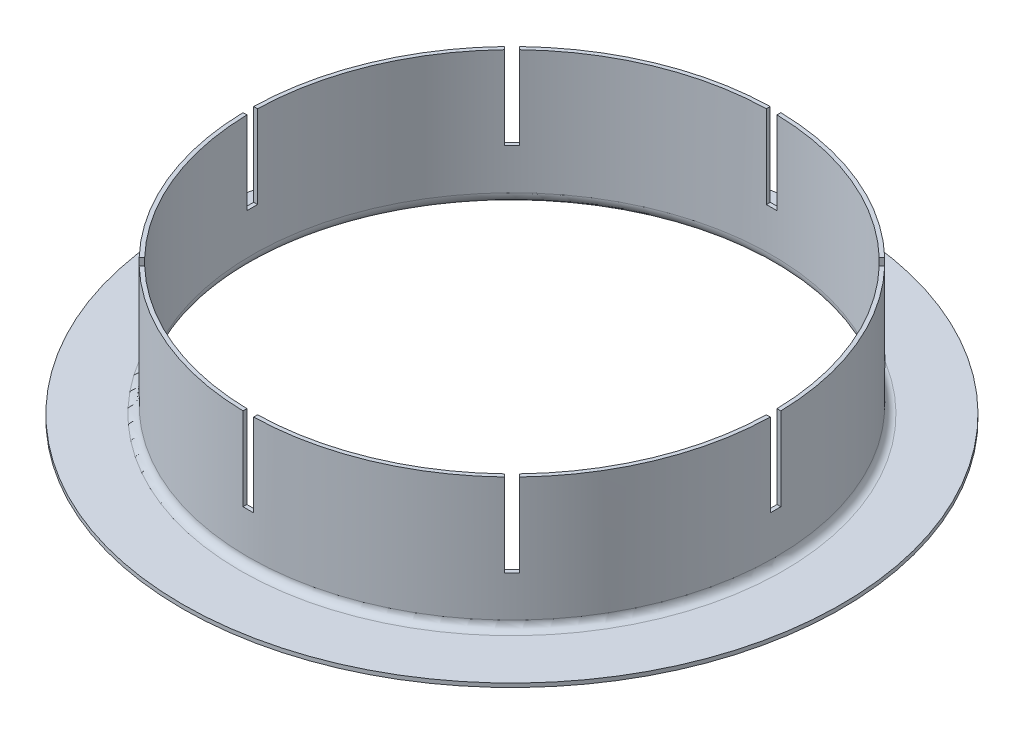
ISO-10303-21;
HEADER;
FILE_DESCRIPTION(('STEP AP214'),'2;1');
FILE_NAME('part.step','',(''),(''),'','','');
FILE_SCHEMA(('AUTOMOTIVE_DESIGN { 1 0 10303 214 1 1 1 1 }'));
ENDSEC;
DATA;
#1=APPLICATION_CONTEXT('core data for automotive mechanical design processes');
#2=APPLICATION_PROTOCOL_DEFINITION('international standard','automotive_design',2000,#1);
#3=PRODUCT_CONTEXT('',#1,'mechanical');
#4=PRODUCT('Part','Part','',(#3));
#5=PRODUCT_RELATED_PRODUCT_CATEGORY('part','',(#4));
#6=PRODUCT_DEFINITION_FORMATION('','',#4);
#7=PRODUCT_DEFINITION_CONTEXT('part definition',#1,'design');
#8=PRODUCT_DEFINITION('design','',#6,#7);
#9=PRODUCT_DEFINITION_SHAPE('','',#8);
#10=(LENGTH_UNIT() NAMED_UNIT(*) SI_UNIT(.MILLI.,.METRE.));
#11=(NAMED_UNIT(*) PLANE_ANGLE_UNIT() SI_UNIT($,.RADIAN.));
#12=(NAMED_UNIT(*) SI_UNIT($,.STERADIAN.) SOLID_ANGLE_UNIT());
#13=UNCERTAINTY_MEASURE_WITH_UNIT(LENGTH_MEASURE(1.E-05),#10,'distance_accuracy_value','');
#14=(GEOMETRIC_REPRESENTATION_CONTEXT(3) GLOBAL_UNCERTAINTY_ASSIGNED_CONTEXT((#13)) GLOBAL_UNIT_ASSIGNED_CONTEXT((#10,
#11,#12)) REPRESENTATION_CONTEXT('',''));
#15=CARTESIAN_POINT('',(0.,0.,0.));
#16=DIRECTION('',(0.,0.,1.));
#17=DIRECTION('',(1.,0.,0.));
#18=AXIS2_PLACEMENT_3D('',#15,#16,#17);
#19=CARTESIAN_POINT('',(0.,0.7366,0.));
#20=DIRECTION('',(0.,1.,0.));
#21=DIRECTION('',(0.,0.,1.));
#22=AXIS2_PLACEMENT_3D('',#19,#20,#21);
#23=CYLINDRICAL_SURFACE('',#22,49.2634000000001);
#24=CARTESIAN_POINT('',(0.,10.,0.));
#25=DIRECTION('',(0.,1.,0.));
#26=DIRECTION('',(0.,0.,1.));
#27=AXIS2_PLACEMENT_3D('',#24,#25,#26);
#28=CIRCLE('',#27,49.2634000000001);
#29=CARTESIAN_POINT('',(34.1201998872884,10.,-35.5344134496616));
#30=VERTEX_POINT('',#29);
#31=CARTESIAN_POINT('',(35.5344134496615,10.,-34.1201998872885));
#32=VERTEX_POINT('',#31);
#33=EDGE_CURVE('E333',#30,#32,#28,.F.);
#34=ORIENTED_EDGE('',*,*,#33,.F.);
#35=DIRECTION('',(0.,1.,0.));
#36=VECTOR('',#35,1.);
#37=CARTESIAN_POINT('',(34.1201998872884,0.7366,-35.5344134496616));
#38=LINE('',#37,#36);
#39=CARTESIAN_POINT('',(34.1201998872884,25.7366,-35.5344134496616));
#40=VERTEX_POINT('',#39);
#41=EDGE_CURVE('E325',#40,#30,#38,.F.);
#42=ORIENTED_EDGE('',*,*,#41,.F.);
#43=CARTESIAN_POINT('',(0.,25.7366,0.));
#44=DIRECTION('',(0.,1.,0.));
#45=DIRECTION('',(0.,0.,1.));
#46=AXIS2_PLACEMENT_3D('',#43,#44,#45);
#47=CIRCLE('',#46,49.2634000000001);
#48=CARTESIAN_POINT('',(0.999999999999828,25.7366,-49.2532494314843));
#49=VERTEX_POINT('',#48);
#50=EDGE_CURVE('E548',#40,#49,#47,.T.);
#51=ORIENTED_EDGE('',*,*,#50,.T.);
#52=DIRECTION('',(0.,1.,0.));
#53=VECTOR('',#52,1.);
#54=CARTESIAN_POINT('',(0.999999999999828,0.7366,-49.2532494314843));
#55=LINE('',#54,#53);
#56=CARTESIAN_POINT('',(0.999999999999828,10.,-49.2532494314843));
#57=VERTEX_POINT('',#56);
#58=EDGE_CURVE('E477',#57,#49,#55,.T.);
#59=ORIENTED_EDGE('',*,*,#58,.F.);
#60=CARTESIAN_POINT('',(0.,10.,0.));
#61=DIRECTION('',(0.,1.,0.));
#62=DIRECTION('',(0.,0.,1.));
#63=AXIS2_PLACEMENT_3D('',#60,#61,#62);
#64=CIRCLE('',#63,49.2634000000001);
#65=CARTESIAN_POINT('',(-1.00000000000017,10.,-49.2532494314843));
#66=VERTEX_POINT('',#65);
#67=EDGE_CURVE('E503',#66,#57,#64,.F.);
#68=ORIENTED_EDGE('',*,*,#67,.F.);
#69=DIRECTION('',(0.,1.,0.));
#70=VECTOR('',#69,1.);
#71=CARTESIAN_POINT('',(-1.00000000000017,0.7366,-49.2532494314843));
#72=LINE('',#71,#70);
#73=CARTESIAN_POINT('',(-1.00000000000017,25.7366,-49.2532494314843));
#74=VERTEX_POINT('',#73);
#75=EDGE_CURVE('E484',#74,#66,#72,.F.);
#76=ORIENTED_EDGE('',*,*,#75,.F.);
#77=CARTESIAN_POINT('',(-34.1201998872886,25.7366,-35.5344134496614));
#78=VERTEX_POINT('',#77);
#79=EDGE_CURVE('E630',#74,#78,#47,.T.);
#80=ORIENTED_EDGE('',*,*,#79,.T.);
#81=DIRECTION('',(0.,1.,0.));
#82=VECTOR('',#81,1.);
#83=CARTESIAN_POINT('',(-34.1201998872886,0.7366,-35.5344134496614));
#84=LINE('',#83,#82);
#85=CARTESIAN_POINT('',(-34.1201998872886,10.,-35.5344134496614));
#86=VERTEX_POINT('',#85);
#87=EDGE_CURVE('E451',#86,#78,#84,.T.);
#88=ORIENTED_EDGE('',*,*,#87,.F.);
#89=CARTESIAN_POINT('',(0.,10.,0.));
#90=DIRECTION('',(0.,1.,0.));
#91=DIRECTION('',(0.,0.,1.));
#92=AXIS2_PLACEMENT_3D('',#89,#90,#91);
#93=CIRCLE('',#92,49.2634000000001);
#94=CARTESIAN_POINT('',(-35.5344134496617,10.,-34.1201998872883));
#95=VERTEX_POINT('',#94);
#96=EDGE_CURVE('E475',#95,#86,#93,.F.);
#97=ORIENTED_EDGE('',*,*,#96,.F.);
#98=DIRECTION('',(0.,1.,0.));
#99=VECTOR('',#98,1.);
#100=CARTESIAN_POINT('',(-35.5344134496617,0.7366,-34.1201998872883));
#101=LINE('',#100,#99);
#102=CARTESIAN_POINT('',(-35.5344134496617,25.7366,-34.1201998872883));
#103=VERTEX_POINT('',#102);
#104=EDGE_CURVE('E458',#103,#95,#101,.F.);
#105=ORIENTED_EDGE('',*,*,#104,.F.);
#106=CARTESIAN_POINT('',(-49.2532494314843,25.7366,-0.999999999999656));
#107=VERTEX_POINT('',#106);
#108=EDGE_CURVE('E628',#103,#107,#47,.T.);
#109=ORIENTED_EDGE('',*,*,#108,.T.);
#110=DIRECTION('',(0.,1.,0.));
#111=VECTOR('',#110,1.);
#112=CARTESIAN_POINT('',(-49.2532494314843,0.7366,-0.999999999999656));
#113=LINE('',#112,#111);
#114=CARTESIAN_POINT('',(-49.2532494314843,10.,-0.999999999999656));
#115=VERTEX_POINT('',#114);
#116=EDGE_CURVE('E425',#115,#107,#113,.T.);
#117=ORIENTED_EDGE('',*,*,#116,.F.);
#118=CARTESIAN_POINT('',(0.,10.,0.));
#119=DIRECTION('',(0.,1.,0.));
#120=DIRECTION('',(0.,0.,1.));
#121=AXIS2_PLACEMENT_3D('',#118,#119,#120);
#122=CIRCLE('',#121,49.2634000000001);
#123=CARTESIAN_POINT('',(-49.2532494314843,10.,1.00000000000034));
#124=VERTEX_POINT('',#123);
#125=EDGE_CURVE('E449',#124,#115,#122,.F.);
#126=ORIENTED_EDGE('',*,*,#125,.F.);
#127=DIRECTION('',(0.,1.,0.));
#128=VECTOR('',#127,1.);
#129=CARTESIAN_POINT('',(-49.2532494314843,0.7366,1.00000000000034));
#130=LINE('',#129,#128);
#131=CARTESIAN_POINT('',(-49.2532494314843,25.7366,1.00000000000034));
#132=VERTEX_POINT('',#131);
#133=EDGE_CURVE('E432',#132,#124,#130,.F.);
#134=ORIENTED_EDGE('',*,*,#133,.F.);
#135=CARTESIAN_POINT('',(-35.5344134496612,25.7366,34.1201998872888));
#136=VERTEX_POINT('',#135);
#137=EDGE_CURVE('E631',#132,#136,#47,.T.);
#138=ORIENTED_EDGE('',*,*,#137,.T.);
#139=DIRECTION('',(0.,1.,0.));
#140=VECTOR('',#139,1.);
#141=CARTESIAN_POINT('',(-35.5344134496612,0.7366,34.1201998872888));
#142=LINE('',#141,#140);
#143=CARTESIAN_POINT('',(-35.5344134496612,10.,34.1201998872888));
#144=VERTEX_POINT('',#143);
#145=EDGE_CURVE('E400',#144,#136,#142,.T.);
#146=ORIENTED_EDGE('',*,*,#145,.F.);
#147=CARTESIAN_POINT('',(0.,10.,0.));
#148=DIRECTION('',(0.,1.,0.));
#149=DIRECTION('',(0.,0.,1.));
#150=AXIS2_PLACEMENT_3D('',#147,#148,#149);
#151=CIRCLE('',#150,49.2634000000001);
#152=CARTESIAN_POINT('',(-34.1201998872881,10.,35.5344134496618));
#153=VERTEX_POINT('',#152);
#154=EDGE_CURVE('E423',#153,#144,#151,.F.);
#155=ORIENTED_EDGE('',*,*,#154,.F.);
#156=DIRECTION('',(0.,1.,0.));
#157=VECTOR('',#156,1.);
#158=CARTESIAN_POINT('',(-34.1201998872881,0.7366,35.5344134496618));
#159=LINE('',#158,#157);
#160=CARTESIAN_POINT('',(-34.1201998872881,25.7366,35.5344134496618));
#161=VERTEX_POINT('',#160);
#162=EDGE_CURVE('E406',#161,#153,#159,.F.);
#163=ORIENTED_EDGE('',*,*,#162,.F.);
#164=CARTESIAN_POINT('',(-0.999999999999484,25.7366,49.2532494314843));
#165=VERTEX_POINT('',#164);
#166=EDGE_CURVE('E542',#161,#165,#47,.T.);
#167=ORIENTED_EDGE('',*,*,#166,.T.);
#168=DIRECTION('',(0.,1.,0.));
#169=VECTOR('',#168,1.);
#170=CARTESIAN_POINT('',(-0.999999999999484,0.7366,49.2532494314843));
#171=LINE('',#170,#169);
#172=CARTESIAN_POINT('',(-0.999999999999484,10.,49.2532494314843));
#173=VERTEX_POINT('',#172);
#174=EDGE_CURVE('E369',#173,#165,#171,.T.);
#175=ORIENTED_EDGE('',*,*,#174,.F.);
#176=CARTESIAN_POINT('',(0.,10.,0.));
#177=DIRECTION('',(0.,1.,0.));
#178=DIRECTION('',(0.,0.,1.));
#179=AXIS2_PLACEMENT_3D('',#176,#177,#178);
#180=CIRCLE('',#179,49.2634000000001);
#181=CARTESIAN_POINT('',(0.,10.,49.2634000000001));
#182=VERTEX_POINT('',#181);
#183=EDGE_CURVE('E382',#182,#173,#180,.F.);
#184=ORIENTED_EDGE('',*,*,#183,.F.);
#185=DIRECTION('',(0.,1.,0.));
#186=VECTOR('',#185,1.);
#187=CARTESIAN_POINT('',(0.,0.7366,49.2634000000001));
#188=LINE('',#187,#186);
#189=CARTESIAN_POINT('',(0.,2.23660000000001,49.2634));
#190=VERTEX_POINT('',#189);
#191=EDGE_CURVE('E535',#190,#182,#188,.T.);
#192=ORIENTED_EDGE('',*,*,#191,.F.);
#193=CARTESIAN_POINT('',(0.,2.23660000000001,0.));
#194=DIRECTION('',(0.,1.,0.));
#195=DIRECTION('',(0.,0.,1.));
#196=AXIS2_PLACEMENT_3D('',#193,#194,#195);
#197=CIRCLE('',#196,49.2634);
#198=EDGE_CURVE('E540',#190,#190,#197,.T.);
#199=ORIENTED_EDGE('',*,*,#198,.F.);
#200=ORIENTED_EDGE('',*,*,#191,.T.);
#201=CARTESIAN_POINT('',(0.,10.,0.));
#202=DIRECTION('',(0.,1.,0.));
#203=DIRECTION('',(0.,0.,1.));
#204=AXIS2_PLACEMENT_3D('',#201,#202,#203);
#205=CIRCLE('',#204,49.2634000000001);
#206=CARTESIAN_POINT('',(1.00000000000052,10.,49.2532494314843));
#207=VERTEX_POINT('',#206);
#208=EDGE_CURVE('E398',#207,#182,#205,.F.);
#209=ORIENTED_EDGE('',*,*,#208,.F.);
#210=DIRECTION('',(0.,1.,0.));
#211=VECTOR('',#210,1.);
#212=CARTESIAN_POINT('',(1.00000000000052,0.7366,49.2532494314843));
#213=LINE('',#212,#211);
#214=CARTESIAN_POINT('',(1.00000000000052,25.7366,49.2532494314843));
#215=VERTEX_POINT('',#214);
#216=EDGE_CURVE('E384',#215,#207,#213,.F.);
#217=ORIENTED_EDGE('',*,*,#216,.F.);
#218=CARTESIAN_POINT('',(34.1201998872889,25.7366,35.5344134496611));
#219=VERTEX_POINT('',#218);
#220=EDGE_CURVE('E543',#215,#219,#47,.T.);
#221=ORIENTED_EDGE('',*,*,#220,.T.);
#222=DIRECTION('',(0.,1.,0.));
#223=VECTOR('',#222,1.);
#224=CARTESIAN_POINT('',(34.1201998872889,0.7366,35.5344134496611));
#225=LINE('',#224,#223);
#226=CARTESIAN_POINT('',(34.1201998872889,10.,35.5344134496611));
#227=VERTEX_POINT('',#226);
#228=EDGE_CURVE('E111',#227,#219,#225,.T.);
#229=ORIENTED_EDGE('',*,*,#228,.F.);
#230=CARTESIAN_POINT('',(0.,10.,0.));
#231=DIRECTION('',(0.,1.,0.));
#232=DIRECTION('',(0.,0.,1.));
#233=AXIS2_PLACEMENT_3D('',#230,#231,#232);
#234=CIRCLE('',#233,49.2634000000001);
#235=CARTESIAN_POINT('',(35.534413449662,10.,34.120199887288));
#236=VERTEX_POINT('',#235);
#237=EDGE_CURVE('E367',#236,#227,#234,.F.);
#238=ORIENTED_EDGE('',*,*,#237,.F.);
#239=DIRECTION('',(0.,1.,0.));
#240=VECTOR('',#239,1.);
#241=CARTESIAN_POINT('',(35.534413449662,0.7366,34.120199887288));
#242=LINE('',#241,#240);
#243=CARTESIAN_POINT('',(35.534413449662,25.7366,34.120199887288));
#244=VERTEX_POINT('',#243);
#245=EDGE_CURVE('E350',#244,#236,#242,.F.);
#246=ORIENTED_EDGE('',*,*,#245,.F.);
#247=CARTESIAN_POINT('',(49.2532494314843,25.7366,1.));
#248=VERTEX_POINT('',#247);
#249=EDGE_CURVE('E547',#244,#248,#47,.T.);
#250=ORIENTED_EDGE('',*,*,#249,.T.);
#251=DIRECTION('',(0.,1.,0.));
#252=VECTOR('',#251,1.);
#253=CARTESIAN_POINT('',(49.2532494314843,0.7366,1.));
#254=LINE('',#253,#252);
#255=CARTESIAN_POINT('',(49.2532494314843,10.,1.));
#256=VERTEX_POINT('',#255);
#257=EDGE_CURVE('E515',#256,#248,#254,.T.);
#258=ORIENTED_EDGE('',*,*,#257,.F.);
#259=CARTESIAN_POINT('',(0.,10.,0.));
#260=DIRECTION('',(0.,1.,0.));
#261=DIRECTION('',(0.,0.,1.));
#262=AXIS2_PLACEMENT_3D('',#259,#260,#261);
#263=CIRCLE('',#262,49.2634000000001);
#264=CARTESIAN_POINT('',(49.2532494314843,10.,-1.));
#265=VERTEX_POINT('',#264);
#266=EDGE_CURVE('E513',#265,#256,#263,.F.);
#267=ORIENTED_EDGE('',*,*,#266,.F.);
#268=DIRECTION('',(0.,1.,0.));
#269=VECTOR('',#268,1.);
#270=CARTESIAN_POINT('',(49.2532494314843,0.7366,-1.));
#271=LINE('',#270,#269);
#272=CARTESIAN_POINT('',(49.2532494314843,25.7366,-1.));
#273=VERTEX_POINT('',#272);
#274=EDGE_CURVE('E532',#273,#265,#271,.F.);
#275=ORIENTED_EDGE('',*,*,#274,.F.);
#276=CARTESIAN_POINT('',(35.5344134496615,25.7366,-34.1201998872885));
#277=VERTEX_POINT('',#276);
#278=EDGE_CURVE('E549',#273,#277,#47,.T.);
#279=ORIENTED_EDGE('',*,*,#278,.T.);
#280=DIRECTION('',(0.,1.,0.));
#281=VECTOR('',#280,1.);
#282=CARTESIAN_POINT('',(35.5344134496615,0.7366,-34.1201998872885));
#283=LINE('',#282,#281);
#284=EDGE_CURVE('E103',#32,#277,#283,.T.);
#285=ORIENTED_EDGE('',*,*,#284,.F.);
#286=EDGE_LOOP('',(#34,#42,#51,#59,#68,#76,#80,#88,#97,#105,#109,#117,#126,#134,#138,#146,#155,
#163,#167,#175,#184,#192,#199,#200,#209,#217,#221,#229,#238,#246,#250,#258,#267,#275,#279,#285));
#287=FACE_BOUND('',#286,.T.);
#288=ADVANCED_FACE('F86',(#287),#23,.F.);
#289=CARTESIAN_POINT('',(0.,0.7366,0.));
#290=DIRECTION('',(0.,1.,0.));
#291=DIRECTION('',(0.,0.,1.));
#292=AXIS2_PLACEMENT_3D('',#289,#290,#291);
#293=CYLINDRICAL_SURFACE('',#292,50.);
#294=DIRECTION('',(0.,1.,0.));
#295=VECTOR('',#294,1.);
#296=CARTESIAN_POINT('',(34.6303745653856,0.7366,-36.0657338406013));
#297=LINE('',#296,#295);
#298=CARTESIAN_POINT('',(34.6303745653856,25.7366,-36.0657338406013));
#299=VERTEX_POINT('',#298);
#300=CARTESIAN_POINT('',(34.6303745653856,10.,-36.0657338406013));
#301=VERTEX_POINT('',#300);
#302=EDGE_CURVE('E324',#299,#301,#297,.F.);
#303=ORIENTED_EDGE('',*,*,#302,.T.);
#304=CARTESIAN_POINT('',(0.,10.,0.));
#305=DIRECTION('',(0.,1.,0.));
#306=DIRECTION('',(0.,0.,1.));
#307=AXIS2_PLACEMENT_3D('',#304,#305,#306);
#308=CIRCLE('',#307,50.);
#309=CARTESIAN_POINT('',(36.0657338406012,10.,-34.6303745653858));
#310=VERTEX_POINT('',#309);
#311=EDGE_CURVE('E330',#301,#310,#308,.F.);
#312=ORIENTED_EDGE('',*,*,#311,.T.);
#313=DIRECTION('',(0.,1.,0.));
#314=VECTOR('',#313,1.);
#315=CARTESIAN_POINT('',(36.0657338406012,0.7366,-34.6303745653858));
#316=LINE('',#315,#314);
#317=CARTESIAN_POINT('',(36.0657338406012,25.7366,-34.6303745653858));
#318=VERTEX_POINT('',#317);
#319=EDGE_CURVE('E315',#310,#318,#316,.T.);
#320=ORIENTED_EDGE('',*,*,#319,.T.);
#321=CARTESIAN_POINT('',(0.,25.7366,0.));
#322=DIRECTION('',(0.,1.,0.));
#323=DIRECTION('',(0.,0.,1.));
#324=AXIS2_PLACEMENT_3D('',#321,#322,#323);
#325=CIRCLE('',#324,50.0000000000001);
#326=CARTESIAN_POINT('',(49.9899989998,25.7366,-1.));
#327=VERTEX_POINT('',#326);
#328=EDGE_CURVE('E562',#327,#318,#325,.T.);
#329=ORIENTED_EDGE('',*,*,#328,.F.);
#330=DIRECTION('',(0.,1.,0.));
#331=VECTOR('',#330,1.);
#332=CARTESIAN_POINT('',(49.9899989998,0.7366,-1.));
#333=LINE('',#332,#331);
#334=CARTESIAN_POINT('',(49.9899989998,10.,-1.));
#335=VERTEX_POINT('',#334);
#336=EDGE_CURVE('E527',#327,#335,#333,.F.);
#337=ORIENTED_EDGE('',*,*,#336,.T.);
#338=CARTESIAN_POINT('',(0.,10.,0.));
#339=DIRECTION('',(0.,1.,0.));
#340=DIRECTION('',(0.,0.,1.));
#341=AXIS2_PLACEMENT_3D('',#338,#339,#340);
#342=CIRCLE('',#341,50.);
#343=CARTESIAN_POINT('',(49.9899989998,10.,1.));
#344=VERTEX_POINT('',#343);
#345=EDGE_CURVE('E505',#335,#344,#342,.F.);
#346=ORIENTED_EDGE('',*,*,#345,.T.);
#347=DIRECTION('',(0.,1.,0.));
#348=VECTOR('',#347,1.);
#349=CARTESIAN_POINT('',(49.9899989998,0.7366,1.));
#350=LINE('',#349,#348);
#351=CARTESIAN_POINT('',(49.9899989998,25.7366,1.));
#352=VERTEX_POINT('',#351);
#353=EDGE_CURVE('E510',#344,#352,#350,.T.);
#354=ORIENTED_EDGE('',*,*,#353,.T.);
#355=CARTESIAN_POINT('',(36.0657338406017,25.7366,34.6303745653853));
#356=VERTEX_POINT('',#355);
#357=EDGE_CURVE('E560',#356,#352,#325,.T.);
#358=ORIENTED_EDGE('',*,*,#357,.F.);
#359=DIRECTION('',(0.,1.,0.));
#360=VECTOR('',#359,1.);
#361=CARTESIAN_POINT('',(36.0657338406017,0.7366,34.6303745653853));
#362=LINE('',#361,#360);
#363=CARTESIAN_POINT('',(36.0657338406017,10.,34.6303745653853));
#364=VERTEX_POINT('',#363);
#365=EDGE_CURVE('E349',#356,#364,#362,.F.);
#366=ORIENTED_EDGE('',*,*,#365,.T.);
#367=CARTESIAN_POINT('',(0.,10.,0.));
#368=DIRECTION('',(0.,1.,0.));
#369=DIRECTION('',(0.,0.,1.));
#370=AXIS2_PLACEMENT_3D('',#367,#368,#369);
#371=CIRCLE('',#370,50.);
#372=CARTESIAN_POINT('',(34.6303745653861,10.,36.0657338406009));
#373=VERTEX_POINT('',#372);
#374=EDGE_CURVE('E365',#364,#373,#371,.F.);
#375=ORIENTED_EDGE('',*,*,#374,.T.);
#376=DIRECTION('',(0.,1.,0.));
#377=VECTOR('',#376,1.);
#378=CARTESIAN_POINT('',(34.6303745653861,0.7366,36.0657338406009));
#379=LINE('',#378,#377);
#380=CARTESIAN_POINT('',(34.6303745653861,25.7366,36.0657338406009));
#381=VERTEX_POINT('',#380);
#382=EDGE_CURVE('E346',#373,#381,#379,.T.);
#383=ORIENTED_EDGE('',*,*,#382,.T.);
#384=CARTESIAN_POINT('',(1.01495227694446,25.7366,49.9896976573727));
#385=VERTEX_POINT('',#384);
#386=EDGE_CURVE('E557',#385,#381,#325,.T.);
#387=ORIENTED_EDGE('',*,*,#386,.F.);
#388=DIRECTION('',(0.,1.,0.));
#389=VECTOR('',#388,1.);
#390=CARTESIAN_POINT('',(1.01495227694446,0.7366,49.9896976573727));
#391=LINE('',#390,#389);
#392=CARTESIAN_POINT('',(1.01495227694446,10.,49.9896976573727));
#393=VERTEX_POINT('',#392);
#394=EDGE_CURVE('E387',#385,#393,#391,.F.);
#395=ORIENTED_EDGE('',*,*,#394,.T.);
#396=CARTESIAN_POINT('',(0.,10.,0.));
#397=DIRECTION('',(0.,1.,0.));
#398=DIRECTION('',(0.,0.,1.));
#399=AXIS2_PLACEMENT_3D('',#396,#397,#398);
#400=CIRCLE('',#399,50.);
#401=CARTESIAN_POINT('',(0.,10.,50.));
#402=VERTEX_POINT('',#401);
#403=EDGE_CURVE('E397',#393,#402,#400,.F.);
#404=ORIENTED_EDGE('',*,*,#403,.T.);
#405=DIRECTION('',(0.,1.,0.));
#406=VECTOR('',#405,1.);
#407=CARTESIAN_POINT('',(0.,0.7366,50.));
#408=LINE('',#407,#406);
#409=CARTESIAN_POINT('',(0.,2.23660000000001,50.));
#410=VERTEX_POINT('',#409);
#411=EDGE_CURVE('E554',#410,#402,#408,.T.);
#412=ORIENTED_EDGE('',*,*,#411,.F.);
#413=CARTESIAN_POINT('',(0.,2.23660000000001,0.));
#414=DIRECTION('',(0.,1.,0.));
#415=DIRECTION('',(0.,0.,1.));
#416=AXIS2_PLACEMENT_3D('',#413,#414,#415);
#417=CIRCLE('',#416,50.);
#418=EDGE_CURVE('E550',#410,#410,#417,.T.);
#419=ORIENTED_EDGE('',*,*,#418,.T.);
#420=ORIENTED_EDGE('',*,*,#411,.T.);
#421=CARTESIAN_POINT('',(0.,10.,0.));
#422=DIRECTION('',(0.,1.,0.));
#423=DIRECTION('',(0.,0.,1.));
#424=AXIS2_PLACEMENT_3D('',#421,#422,#423);
#425=CIRCLE('',#424,50.);
#426=CARTESIAN_POINT('',(-1.01495227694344,10.,49.9896976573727));
#427=VERTEX_POINT('',#426);
#428=EDGE_CURVE('E380',#402,#427,#425,.F.);
#429=ORIENTED_EDGE('',*,*,#428,.T.);
#430=DIRECTION('',(0.,1.,0.));
#431=VECTOR('',#430,1.);
#432=CARTESIAN_POINT('',(-1.01495227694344,0.7366,49.9896976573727));
#433=LINE('',#432,#431);
#434=CARTESIAN_POINT('',(-1.01495227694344,25.7366,49.9896976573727));
#435=VERTEX_POINT('',#434);
#436=EDGE_CURVE('E372',#427,#435,#433,.T.);
#437=ORIENTED_EDGE('',*,*,#436,.T.);
#438=CARTESIAN_POINT('',(-34.6303745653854,25.7366,36.0657338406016));
#439=VERTEX_POINT('',#438);
#440=EDGE_CURVE('E553',#439,#435,#325,.T.);
#441=ORIENTED_EDGE('',*,*,#440,.F.);
#442=DIRECTION('',(0.,1.,0.));
#443=VECTOR('',#442,1.);
#444=CARTESIAN_POINT('',(-34.6303745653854,0.7366,36.0657338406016));
#445=LINE('',#444,#443);
#446=CARTESIAN_POINT('',(-34.6303745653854,10.,36.0657338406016));
#447=VERTEX_POINT('',#446);
#448=EDGE_CURVE('E405',#439,#447,#445,.F.);
#449=ORIENTED_EDGE('',*,*,#448,.T.);
#450=CARTESIAN_POINT('',(0.,10.,0.));
#451=DIRECTION('',(0.,1.,0.));
#452=DIRECTION('',(0.,0.,1.));
#453=AXIS2_PLACEMENT_3D('',#450,#451,#452);
#454=CIRCLE('',#453,50.);
#455=CARTESIAN_POINT('',(-36.065733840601,10.,34.630374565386));
#456=VERTEX_POINT('',#455);
#457=EDGE_CURVE('E421',#447,#456,#454,.F.);
#458=ORIENTED_EDGE('',*,*,#457,.T.);
#459=DIRECTION('',(0.,1.,0.));
#460=VECTOR('',#459,1.);
#461=CARTESIAN_POINT('',(-36.065733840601,0.7366,34.630374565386));
#462=LINE('',#461,#460);
#463=CARTESIAN_POINT('',(-36.065733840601,25.7366,34.630374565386));
#464=VERTEX_POINT('',#463);
#465=EDGE_CURVE('E402',#456,#464,#462,.T.);
#466=ORIENTED_EDGE('',*,*,#465,.T.);
#467=CARTESIAN_POINT('',(-49.9896976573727,25.7366,1.01495227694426));
#468=VERTEX_POINT('',#467);
#469=EDGE_CURVE('E595',#468,#464,#325,.T.);
#470=ORIENTED_EDGE('',*,*,#469,.F.);
#471=DIRECTION('',(0.,1.,0.));
#472=VECTOR('',#471,1.);
#473=CARTESIAN_POINT('',(-49.9896976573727,0.7366,1.01495227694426));
#474=LINE('',#473,#472);
#475=CARTESIAN_POINT('',(-49.9896976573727,10.,1.01495227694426));
#476=VERTEX_POINT('',#475);
#477=EDGE_CURVE('E431',#468,#476,#474,.F.);
#478=ORIENTED_EDGE('',*,*,#477,.T.);
#479=CARTESIAN_POINT('',(0.,10.,0.));
#480=DIRECTION('',(0.,1.,0.));
#481=DIRECTION('',(0.,0.,1.));
#482=AXIS2_PLACEMENT_3D('',#479,#480,#481);
#483=CIRCLE('',#482,50.);
#484=CARTESIAN_POINT('',(-49.9896976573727,10.,-1.01495227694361));
#485=VERTEX_POINT('',#484);
#486=EDGE_CURVE('E447',#476,#485,#483,.F.);
#487=ORIENTED_EDGE('',*,*,#486,.T.);
#488=DIRECTION('',(0.,1.,0.));
#489=VECTOR('',#488,1.);
#490=CARTESIAN_POINT('',(-49.9896976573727,0.7366,-1.01495227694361));
#491=LINE('',#490,#489);
#492=CARTESIAN_POINT('',(-49.9896976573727,25.7366,-1.01495227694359));
#493=VERTEX_POINT('',#492);
#494=EDGE_CURVE('E428',#485,#493,#491,.T.);
#495=ORIENTED_EDGE('',*,*,#494,.T.);
#496=CARTESIAN_POINT('',(-36.0657338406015,25.7366,-34.6303745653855));
#497=VERTEX_POINT('',#496);
#498=EDGE_CURVE('E597',#497,#493,#325,.T.);
#499=ORIENTED_EDGE('',*,*,#498,.F.);
#500=DIRECTION('',(0.,1.,0.));
#501=VECTOR('',#500,1.);
#502=CARTESIAN_POINT('',(-36.0657338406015,0.7366,-34.6303745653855));
#503=LINE('',#502,#501);
#504=CARTESIAN_POINT('',(-36.0657338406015,10.,-34.6303745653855));
#505=VERTEX_POINT('',#504);
#506=EDGE_CURVE('E457',#497,#505,#503,.F.);
#507=ORIENTED_EDGE('',*,*,#506,.T.);
#508=CARTESIAN_POINT('',(0.,10.,0.));
#509=DIRECTION('',(0.,1.,0.));
#510=DIRECTION('',(0.,0.,1.));
#511=AXIS2_PLACEMENT_3D('',#508,#509,#510);
#512=CIRCLE('',#511,50.);
#513=CARTESIAN_POINT('',(-34.6303745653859,10.,-36.0657338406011));
#514=VERTEX_POINT('',#513);
#515=EDGE_CURVE('E473',#505,#514,#512,.F.);
#516=ORIENTED_EDGE('',*,*,#515,.T.);
#517=DIRECTION('',(0.,1.,0.));
#518=VECTOR('',#517,1.);
#519=CARTESIAN_POINT('',(-34.6303745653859,0.7366,-36.0657338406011));
#520=LINE('',#519,#518);
#521=CARTESIAN_POINT('',(-34.6303745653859,25.7366,-36.0657338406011));
#522=VERTEX_POINT('',#521);
#523=EDGE_CURVE('E454',#514,#522,#520,.T.);
#524=ORIENTED_EDGE('',*,*,#523,.T.);
#525=CARTESIAN_POINT('',(-1.01495227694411,25.7366,-49.9896976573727));
#526=VERTEX_POINT('',#525);
#527=EDGE_CURVE('E601',#526,#522,#325,.T.);
#528=ORIENTED_EDGE('',*,*,#527,.F.);
#529=DIRECTION('',(0.,1.,0.));
#530=VECTOR('',#529,1.);
#531=CARTESIAN_POINT('',(-1.01495227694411,0.7366,-49.9896976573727));
#532=LINE('',#531,#530);
#533=CARTESIAN_POINT('',(-1.01495227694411,10.,-49.9896976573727));
#534=VERTEX_POINT('',#533);
#535=EDGE_CURVE('E483',#526,#534,#532,.F.);
#536=ORIENTED_EDGE('',*,*,#535,.T.);
#537=CARTESIAN_POINT('',(0.,10.,0.));
#538=DIRECTION('',(0.,1.,0.));
#539=DIRECTION('',(0.,0.,1.));
#540=AXIS2_PLACEMENT_3D('',#537,#538,#539);
#541=CIRCLE('',#540,50.);
#542=CARTESIAN_POINT('',(1.01495227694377,10.,-49.9896976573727));
#543=VERTEX_POINT('',#542);
#544=EDGE_CURVE('E500',#534,#543,#541,.F.);
#545=ORIENTED_EDGE('',*,*,#544,.T.);
#546=DIRECTION('',(0.,1.,0.));
#547=VECTOR('',#546,1.);
#548=CARTESIAN_POINT('',(1.01495227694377,0.7366,-49.9896976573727));
#549=LINE('',#548,#547);
#550=CARTESIAN_POINT('',(1.01495227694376,25.7366,-49.9896976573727));
#551=VERTEX_POINT('',#550);
#552=EDGE_CURVE('E480',#543,#551,#549,.T.);
#553=ORIENTED_EDGE('',*,*,#552,.T.);
#554=EDGE_CURVE('E561',#299,#551,#325,.T.);
#555=ORIENTED_EDGE('',*,*,#554,.F.);
#556=EDGE_LOOP('',(#303,#312,#320,#329,#337,#346,#354,#358,#366,#375,#383,#387,#395,#404,#412,
#419,#420,#429,#437,#441,#449,#458,#466,#470,#478,#487,#495,#499,#507,#516,#524,#528,#536,#545,
#553,#555));
#557=FACE_BOUND('',#556,.T.);
#558=ADVANCED_FACE('F337',(#557),#293,.T.);
#559=CARTESIAN_POINT('',(0.,25.7366,0.));
#560=DIRECTION('',(0.,-1.,0.));
#561=DIRECTION('',(0.,0.,-1.));
#562=AXIS2_PLACEMENT_3D('',#559,#560,#561);
#563=PLANE('',#562);
#564=ORIENTED_EDGE('',*,*,#50,.F.);
#565=DIRECTION('',(-0.692607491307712,0.,0.721314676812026));
#566=VECTOR('',#565,1.);
#567=CARTESIAN_POINT('',(34.1201998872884,25.7366,-35.5344134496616));
#568=LINE('',#567,#566);
#569=EDGE_CURVE('E339',#40,#299,#568,.F.);
#570=ORIENTED_EDGE('',*,*,#569,.T.);
#571=ORIENTED_EDGE('',*,*,#554,.T.);
#572=DIRECTION('',(-0.0202990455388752,0.,0.999793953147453));
#573=VECTOR('',#572,1.);
#574=CARTESIAN_POINT('',(0.999999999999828,25.7366,-49.2532494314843));
#575=LINE('',#574,#573);
#576=EDGE_CURVE('E487',#49,#551,#575,.F.);
#577=ORIENTED_EDGE('',*,*,#576,.F.);
#578=EDGE_LOOP('',(#564,#570,#571,#577));
#579=FACE_BOUND('',#578,.T.);
#580=ADVANCED_FACE('F647',(#579),#563,.F.);
#581=ORIENTED_EDGE('',*,*,#328,.T.);
#582=DIRECTION('',(-0.721314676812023,0.,0.692607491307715));
#583=VECTOR('',#582,1.);
#584=CARTESIAN_POINT('',(35.5344134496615,25.7366,-34.1201998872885));
#585=LINE('',#584,#583);
#586=EDGE_CURVE('E319',#277,#318,#585,.F.);
#587=ORIENTED_EDGE('',*,*,#586,.F.);
#588=ORIENTED_EDGE('',*,*,#278,.F.);
#589=DIRECTION('',(1.,0.,0.));
#590=VECTOR('',#589,1.);
#591=CARTESIAN_POINT('',(62.501,25.7366,-1.));
#592=LINE('',#591,#590);
#593=EDGE_CURVE('E530',#327,#273,#592,.F.);
#594=ORIENTED_EDGE('',*,*,#593,.F.);
#595=EDGE_LOOP('',(#581,#587,#588,#594));
#596=FACE_BOUND('',#595,.T.);
#597=ADVANCED_FACE('F649',(#596),#563,.F.);
#598=ORIENTED_EDGE('',*,*,#249,.F.);
#599=DIRECTION('',(-0.721314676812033,0.,-0.692607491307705));
#600=VECTOR('',#599,1.);
#601=CARTESIAN_POINT('',(35.534413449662,25.7366,34.120199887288));
#602=LINE('',#601,#600);
#603=EDGE_CURVE('E362',#244,#356,#602,.F.);
#604=ORIENTED_EDGE('',*,*,#603,.T.);
#605=ORIENTED_EDGE('',*,*,#357,.T.);
#606=DIRECTION('',(-1.,0.,0.));
#607=VECTOR('',#606,1.);
#608=CARTESIAN_POINT('',(62.501,25.7366,1.));
#609=LINE('',#608,#607);
#610=EDGE_CURVE('E518',#248,#352,#609,.F.);
#611=ORIENTED_EDGE('',*,*,#610,.F.);
#612=EDGE_LOOP('',(#598,#604,#605,#611));
#613=FACE_BOUND('',#612,.T.);
#614=ADVANCED_FACE('F655',(#613),#563,.F.);
#615=ORIENTED_EDGE('',*,*,#386,.T.);
#616=DIRECTION('',(-0.692607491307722,0.,-0.721314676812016));
#617=VECTOR('',#616,1.);
#618=CARTESIAN_POINT('',(34.1201998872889,25.7366,35.5344134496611));
#619=LINE('',#618,#617);
#620=EDGE_CURVE('E353',#219,#381,#619,.F.);
#621=ORIENTED_EDGE('',*,*,#620,.F.);
#622=ORIENTED_EDGE('',*,*,#220,.F.);
#623=DIRECTION('',(-0.0202990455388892,0.,-0.999793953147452));
#624=VECTOR('',#623,1.);
#625=CARTESIAN_POINT('',(1.00000000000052,25.7366,49.2532494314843));
#626=LINE('',#625,#624);
#627=EDGE_CURVE('E394',#215,#385,#626,.F.);
#628=ORIENTED_EDGE('',*,*,#627,.T.);
#629=EDGE_LOOP('',(#615,#621,#622,#628));
#630=FACE_BOUND('',#629,.T.);
#631=ADVANCED_FACE('F661',(#630),#563,.F.);
#632=ORIENTED_EDGE('',*,*,#440,.T.);
#633=DIRECTION('',(0.0202990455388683,0.,-0.999793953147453));
#634=VECTOR('',#633,1.);
#635=CARTESIAN_POINT('',(-0.999999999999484,25.7366,49.2532494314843));
#636=LINE('',#635,#634);
#637=EDGE_CURVE('E375',#165,#435,#636,.F.);
#638=ORIENTED_EDGE('',*,*,#637,.F.);
#639=ORIENTED_EDGE('',*,*,#166,.F.);
#640=DIRECTION('',(0.692607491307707,0.,-0.721314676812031));
#641=VECTOR('',#640,1.);
#642=CARTESIAN_POINT('',(-34.1201998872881,25.7366,35.5344134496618));
#643=LINE('',#642,#641);
#644=EDGE_CURVE('E418',#161,#439,#643,.F.);
#645=ORIENTED_EDGE('',*,*,#644,.T.);
#646=EDGE_LOOP('',(#632,#638,#639,#645));
#647=FACE_BOUND('',#646,.T.);
#648=ADVANCED_FACE('F592',(#647),#563,.F.);
#649=ORIENTED_EDGE('',*,*,#469,.T.);
#650=DIRECTION('',(0.721314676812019,0.,-0.69260749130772));
#651=VECTOR('',#650,1.);
#652=CARTESIAN_POINT('',(-35.5344134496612,25.7366,34.1201998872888));
#653=LINE('',#652,#651);
#654=EDGE_CURVE('E409',#136,#464,#653,.F.);
#655=ORIENTED_EDGE('',*,*,#654,.F.);
#656=ORIENTED_EDGE('',*,*,#137,.F.);
#657=DIRECTION('',(0.999793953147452,0.,-0.0202990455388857));
#658=VECTOR('',#657,1.);
#659=CARTESIAN_POINT('',(-49.2532494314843,25.7366,1.00000000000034));
#660=LINE('',#659,#658);
#661=EDGE_CURVE('E444',#132,#468,#660,.F.);
#662=ORIENTED_EDGE('',*,*,#661,.T.);
#663=EDGE_LOOP('',(#649,#655,#656,#662));
#664=FACE_BOUND('',#663,.T.);
#665=ADVANCED_FACE('F660',(#664),#563,.F.);
#666=ORIENTED_EDGE('',*,*,#498,.T.);
#667=DIRECTION('',(0.999793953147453,0.,0.0202990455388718));
#668=VECTOR('',#667,1.);
#669=CARTESIAN_POINT('',(-49.2532494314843,25.7366,-0.999999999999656));
#670=LINE('',#669,#668);
#671=EDGE_CURVE('E435',#107,#493,#670,.F.);
#672=ORIENTED_EDGE('',*,*,#671,.F.);
#673=ORIENTED_EDGE('',*,*,#108,.F.);
#674=DIRECTION('',(0.721314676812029,0.,0.692607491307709));
#675=VECTOR('',#674,1.);
#676=CARTESIAN_POINT('',(-35.5344134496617,25.7366,-34.1201998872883));
#677=LINE('',#676,#675);
#678=EDGE_CURVE('E470',#103,#497,#677,.F.);
#679=ORIENTED_EDGE('',*,*,#678,.T.);
#680=EDGE_LOOP('',(#666,#672,#673,#679));
#681=FACE_BOUND('',#680,.T.);
#682=ADVANCED_FACE('F612',(#681),#563,.F.);
#683=ORIENTED_EDGE('',*,*,#527,.T.);
#684=DIRECTION('',(0.692607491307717,0.,0.721314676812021));
#685=VECTOR('',#684,1.);
#686=CARTESIAN_POINT('',(-34.1201998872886,25.7366,-35.5344134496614));
#687=LINE('',#686,#685);
#688=EDGE_CURVE('E461',#78,#522,#687,.F.);
#689=ORIENTED_EDGE('',*,*,#688,.F.);
#690=ORIENTED_EDGE('',*,*,#79,.F.);
#691=DIRECTION('',(0.0202990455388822,0.,0.999793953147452));
#692=VECTOR('',#691,1.);
#693=CARTESIAN_POINT('',(-1.00000000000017,25.7366,-49.2532494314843));
#694=LINE('',#693,#692);
#695=EDGE_CURVE('E497',#74,#526,#694,.F.);
#696=ORIENTED_EDGE('',*,*,#695,.T.);
#697=EDGE_LOOP('',(#683,#689,#690,#696));
#698=FACE_BOUND('',#697,.T.);
#699=ADVANCED_FACE('F662',(#698),#563,.F.);
#700=CARTESIAN_POINT('',(0.,0.7366,0.));
#701=DIRECTION('',(0.,1.,0.));
#702=DIRECTION('',(0.,0.,1.));
#703=AXIS2_PLACEMENT_3D('',#700,#701,#702);
#704=PLANE('',#703);
#705=CARTESIAN_POINT('',(0.,0.7366,0.));
#706=DIRECTION('',(0.,1.,0.));
#707=DIRECTION('',(0.,0.,1.));
#708=AXIS2_PLACEMENT_3D('',#705,#706,#707);
#709=CIRCLE('',#708,51.5);
#710=CARTESIAN_POINT('',(0.,0.7366,51.5));
#711=VERTEX_POINT('',#710);
#712=EDGE_CURVE('E12',#711,#711,#709,.T.);
#713=ORIENTED_EDGE('',*,*,#712,.F.);
#714=EDGE_LOOP('',(#713));
#715=FACE_BOUND('',#714,.T.);
#716=CARTESIAN_POINT('',(0.,0.7366,0.));
#717=DIRECTION('',(0.,1.,0.));
#718=DIRECTION('',(0.,0.,1.));
#719=AXIS2_PLACEMENT_3D('',#716,#717,#718);
#720=CIRCLE('',#719,62.5);
#721=CARTESIAN_POINT('',(0.,0.7366,62.5));
#722=VERTEX_POINT('',#721);
#723=EDGE_CURVE('E95',#722,#722,#720,.T.);
#724=ORIENTED_EDGE('',*,*,#723,.T.);
#725=EDGE_LOOP('',(#724));
#726=FACE_BOUND('',#725,.T.);
#727=ADVANCED_FACE('F880',(#715,#726),#704,.T.);
#728=CARTESIAN_POINT('',(0.,0.,0.));
#729=DIRECTION('',(0.,1.,0.));
#730=DIRECTION('',(0.,0.,1.));
#731=AXIS2_PLACEMENT_3D('',#728,#729,#730);
#732=PLANE('',#731);
#733=CARTESIAN_POINT('',(0.,0.,0.));
#734=DIRECTION('',(0.,1.,0.));
#735=DIRECTION('',(0.,0.,1.));
#736=AXIS2_PLACEMENT_3D('',#733,#734,#735);
#737=CIRCLE('',#736,51.5);
#738=CARTESIAN_POINT('',(0.,0.,51.5));
#739=VERTEX_POINT('',#738);
#740=EDGE_CURVE('E538',#739,#739,#737,.T.);
#741=ORIENTED_EDGE('',*,*,#740,.T.);
#742=EDGE_LOOP('',(#741));
#743=FACE_BOUND('',#742,.T.);
#744=CARTESIAN_POINT('',(0.,0.,0.));
#745=DIRECTION('',(0.,1.,0.));
#746=DIRECTION('',(0.,0.,1.));
#747=AXIS2_PLACEMENT_3D('',#744,#745,#746);
#748=CIRCLE('',#747,62.5);
#749=CARTESIAN_POINT('',(0.,0.,62.5));
#750=VERTEX_POINT('',#749);
#751=EDGE_CURVE('E546',#750,#750,#748,.T.);
#752=ORIENTED_EDGE('',*,*,#751,.F.);
#753=EDGE_LOOP('',(#752));
#754=FACE_BOUND('',#753,.T.);
#755=ADVANCED_FACE('F875',(#743,#754),#732,.F.);
#756=CARTESIAN_POINT('',(0.,0.7366,0.));
#757=DIRECTION('',(0.,-1.,0.));
#758=DIRECTION('',(0.,0.,-1.));
#759=AXIS2_PLACEMENT_3D('',#756,#757,#758);
#760=CYLINDRICAL_SURFACE('',#759,62.5);
#761=ORIENTED_EDGE('',*,*,#723,.F.);
#762=EDGE_LOOP('',(#761));
#763=FACE_BOUND('',#762,.T.);
#764=ORIENTED_EDGE('',*,*,#751,.T.);
#765=EDGE_LOOP('',(#764));
#766=FACE_BOUND('',#765,.T.);
#767=ADVANCED_FACE('F88',(#763,#766),#760,.T.);
#768=CARTESIAN_POINT('',(0.,2.2366,0.));
#769=DIRECTION('',(0.,1.,0.));
#770=DIRECTION('',(0.,0.,1.));
#771=AXIS2_PLACEMENT_3D('',#768,#769,#770);
#772=TOROIDAL_SURFACE('',#771,51.5,2.2366);
#773=CARTESIAN_POINT('',(0.,2.2366,51.5));
#774=DIRECTION('',(-1.,0.,0.));
#775=DIRECTION('',(0.,0.,1.));
#776=AXIS2_PLACEMENT_3D('',#773,#774,#775);
#777=CIRCLE('',#776,2.2366);
#778=EDGE_CURVE('E539',#739,#190,#777,.F.);
#779=ORIENTED_EDGE('',*,*,#778,.F.);
#780=ORIENTED_EDGE('',*,*,#740,.F.);
#781=ORIENTED_EDGE('',*,*,#778,.T.);
#782=ORIENTED_EDGE('',*,*,#198,.T.);
#783=EDGE_LOOP('',(#779,#780,#781,#782));
#784=FACE_BOUND('',#783,.T.);
#785=ADVANCED_FACE('F671',(#784),#772,.T.);
#786=CARTESIAN_POINT('',(0.,2.2366,0.));
#787=DIRECTION('',(0.,1.,0.));
#788=DIRECTION('',(0.,0.,1.));
#789=AXIS2_PLACEMENT_3D('',#786,#787,#788);
#790=TOROIDAL_SURFACE('',#789,51.5,1.5);
#791=CARTESIAN_POINT('',(0.,2.2366,51.5));
#792=DIRECTION('',(-1.,0.,0.));
#793=DIRECTION('',(0.,-1.,0.));
#794=AXIS2_PLACEMENT_3D('',#791,#792,#793);
#795=CIRCLE('',#794,1.5);
#796=EDGE_CURVE('E534',#711,#410,#795,.F.);
#797=ORIENTED_EDGE('',*,*,#796,.T.);
#798=ORIENTED_EDGE('',*,*,#418,.F.);
#799=ORIENTED_EDGE('',*,*,#796,.F.);
#800=ORIENTED_EDGE('',*,*,#712,.T.);
#801=EDGE_LOOP('',(#797,#798,#799,#800));
#802=FACE_BOUND('',#801,.T.);
#803=ADVANCED_FACE('F579',(#802),#790,.F.);
#804=CARTESIAN_POINT('',(62.501,10.,1.));
#805=DIRECTION('',(0.,1.,0.));
#806=DIRECTION('',(0.,0.,1.));
#807=AXIS2_PLACEMENT_3D('',#804,#805,#806);
#808=PLANE('',#807);
#809=ORIENTED_EDGE('',*,*,#266,.T.);
#810=DIRECTION('',(-1.,0.,0.));
#811=VECTOR('',#810,1.);
#812=CARTESIAN_POINT('',(62.501,10.,1.));
#813=LINE('',#812,#811);
#814=EDGE_CURVE('E524',#344,#256,#813,.T.);
#815=ORIENTED_EDGE('',*,*,#814,.F.);
#816=ORIENTED_EDGE('',*,*,#345,.F.);
#817=DIRECTION('',(-1.,0.,0.));
#818=VECTOR('',#817,1.);
#819=CARTESIAN_POINT('',(62.501,10.,-1.));
#820=LINE('',#819,#818);
#821=EDGE_CURVE('E521',#335,#265,#820,.T.);
#822=ORIENTED_EDGE('',*,*,#821,.T.);
#823=EDGE_LOOP('',(#809,#815,#816,#822));
#824=FACE_BOUND('',#823,.T.);
#825=ADVANCED_FACE('F676',(#824),#808,.T.);
#826=CARTESIAN_POINT('',(62.501,10.,1.));
#827=DIRECTION('',(0.,0.,-1.));
#828=DIRECTION('',(-1.,0.,0.));
#829=AXIS2_PLACEMENT_3D('',#826,#827,#828);
#830=PLANE('',#829);
#831=ORIENTED_EDGE('',*,*,#257,.T.);
#832=ORIENTED_EDGE('',*,*,#610,.T.);
#833=ORIENTED_EDGE('',*,*,#353,.F.);
#834=ORIENTED_EDGE('',*,*,#814,.T.);
#835=EDGE_LOOP('',(#831,#832,#833,#834));
#836=FACE_BOUND('',#835,.T.);
#837=ADVANCED_FACE('F669',(#836),#830,.T.);
#838=CARTESIAN_POINT('',(62.501,10.,-1.));
#839=DIRECTION('',(0.,0.,1.));
#840=DIRECTION('',(1.,0.,0.));
#841=AXIS2_PLACEMENT_3D('',#838,#839,#840);
#842=PLANE('',#841);
#843=ORIENTED_EDGE('',*,*,#274,.T.);
#844=ORIENTED_EDGE('',*,*,#821,.F.);
#845=ORIENTED_EDGE('',*,*,#336,.F.);
#846=ORIENTED_EDGE('',*,*,#593,.T.);
#847=EDGE_LOOP('',(#843,#844,#845,#846));
#848=FACE_BOUND('',#847,.T.);
#849=ADVANCED_FACE('F684',(#848),#842,.T.);
#850=CARTESIAN_POINT('',(-1.00000000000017,17.8683,-49.2532494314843));
#851=DIRECTION('',(-0.999793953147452,0.,0.0202990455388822));
#852=DIRECTION('',(0.,1.,0.));
#853=AXIS2_PLACEMENT_3D('',#850,#851,#852);
#854=PLANE('',#853);
#855=ORIENTED_EDGE('',*,*,#695,.F.);
#856=ORIENTED_EDGE('',*,*,#75,.T.);
#857=DIRECTION('',(0.0202990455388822,0.,0.999793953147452));
#858=VECTOR('',#857,1.);
#859=CARTESIAN_POINT('',(-1.00000000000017,10.,-49.2532494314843));
#860=LINE('',#859,#858);
#861=EDGE_CURVE('E494',#66,#534,#860,.F.);
#862=ORIENTED_EDGE('',*,*,#861,.T.);
#863=ORIENTED_EDGE('',*,*,#535,.F.);
#864=EDGE_LOOP('',(#855,#856,#862,#863));
#865=FACE_BOUND('',#864,.T.);
#866=ADVANCED_FACE('F689',(#865),#854,.F.);
#867=CARTESIAN_POINT('',(0.,10.,0.));
#868=DIRECTION('',(0.,-1.,0.));
#869=DIRECTION('',(0.,0.,-1.));
#870=AXIS2_PLACEMENT_3D('',#867,#868,#869);
#871=PLANE('',#870);
#872=ORIENTED_EDGE('',*,*,#544,.F.);
#873=ORIENTED_EDGE('',*,*,#861,.F.);
#874=ORIENTED_EDGE('',*,*,#67,.T.);
#875=DIRECTION('',(-0.0202990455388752,0.,0.999793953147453));
#876=VECTOR('',#875,1.);
#877=CARTESIAN_POINT('',(0.999999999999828,10.,-49.2532494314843));
#878=LINE('',#877,#876);
#879=EDGE_CURVE('E491',#57,#543,#878,.F.);
#880=ORIENTED_EDGE('',*,*,#879,.T.);
#881=EDGE_LOOP('',(#872,#873,#874,#880));
#882=FACE_BOUND('',#881,.T.);
#883=ADVANCED_FACE('F691',(#882),#871,.F.);
#884=CARTESIAN_POINT('',(0.999999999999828,17.8683,-49.2532494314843));
#885=DIRECTION('',(-0.999793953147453,0.,-0.0202990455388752));
#886=DIRECTION('',(0.,1.,0.));
#887=AXIS2_PLACEMENT_3D('',#884,#885,#886);
#888=PLANE('',#887);
#889=ORIENTED_EDGE('',*,*,#879,.F.);
#890=ORIENTED_EDGE('',*,*,#58,.T.);
#891=ORIENTED_EDGE('',*,*,#576,.T.);
#892=ORIENTED_EDGE('',*,*,#552,.F.);
#893=EDGE_LOOP('',(#889,#890,#891,#892));
#894=FACE_BOUND('',#893,.T.);
#895=ADVANCED_FACE('F646',(#894),#888,.T.);
#896=CARTESIAN_POINT('',(-35.5344134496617,17.8683,-34.1201998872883));
#897=DIRECTION('',(-0.692607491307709,0.,0.721314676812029));
#898=DIRECTION('',(0.,1.,0.));
#899=AXIS2_PLACEMENT_3D('',#896,#897,#898);
#900=PLANE('',#899);
#901=ORIENTED_EDGE('',*,*,#678,.F.);
#902=ORIENTED_EDGE('',*,*,#104,.T.);
#903=DIRECTION('',(0.721314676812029,0.,0.692607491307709));
#904=VECTOR('',#903,1.);
#905=CARTESIAN_POINT('',(-35.5344134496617,10.,-34.1201998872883));
#906=LINE('',#905,#904);
#907=EDGE_CURVE('E467',#95,#505,#906,.F.);
#908=ORIENTED_EDGE('',*,*,#907,.T.);
#909=ORIENTED_EDGE('',*,*,#506,.F.);
#910=EDGE_LOOP('',(#901,#902,#908,#909));
#911=FACE_BOUND('',#910,.T.);
#912=ADVANCED_FACE('F700',(#911),#900,.F.);
#913=CARTESIAN_POINT('',(0.,10.,0.));
#914=DIRECTION('',(0.,-1.,0.));
#915=DIRECTION('',(0.,0.,-1.));
#916=AXIS2_PLACEMENT_3D('',#913,#914,#915);
#917=PLANE('',#916);
#918=ORIENTED_EDGE('',*,*,#515,.F.);
#919=ORIENTED_EDGE('',*,*,#907,.F.);
#920=ORIENTED_EDGE('',*,*,#96,.T.);
#921=DIRECTION('',(0.692607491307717,0.,0.721314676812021));
#922=VECTOR('',#921,1.);
#923=CARTESIAN_POINT('',(-34.1201998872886,10.,-35.5344134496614));
#924=LINE('',#923,#922);
#925=EDGE_CURVE('E464',#86,#514,#924,.F.);
#926=ORIENTED_EDGE('',*,*,#925,.T.);
#927=EDGE_LOOP('',(#918,#919,#920,#926));
#928=FACE_BOUND('',#927,.T.);
#929=ADVANCED_FACE('F701',(#928),#917,.F.);
#930=CARTESIAN_POINT('',(-34.1201998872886,17.8683,-35.5344134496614));
#931=DIRECTION('',(-0.721314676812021,0.,0.692607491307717));
#932=DIRECTION('',(0.,1.,0.));
#933=AXIS2_PLACEMENT_3D('',#930,#931,#932);
#934=PLANE('',#933);
#935=ORIENTED_EDGE('',*,*,#925,.F.);
#936=ORIENTED_EDGE('',*,*,#87,.T.);
#937=ORIENTED_EDGE('',*,*,#688,.T.);
#938=ORIENTED_EDGE('',*,*,#523,.F.);
#939=EDGE_LOOP('',(#935,#936,#937,#938));
#940=FACE_BOUND('',#939,.T.);
#941=ADVANCED_FACE('F704',(#940),#934,.T.);
#942=CARTESIAN_POINT('',(-49.2532494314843,17.8683,1.00000000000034));
#943=DIRECTION('',(0.0202990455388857,0.,0.999793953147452));
#944=DIRECTION('',(0.,1.,0.));
#945=AXIS2_PLACEMENT_3D('',#942,#943,#944);
#946=PLANE('',#945);
#947=ORIENTED_EDGE('',*,*,#661,.F.);
#948=ORIENTED_EDGE('',*,*,#133,.T.);
#949=DIRECTION('',(0.999793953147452,0.,-0.0202990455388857));
#950=VECTOR('',#949,1.);
#951=CARTESIAN_POINT('',(-49.2532494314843,10.,1.00000000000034));
#952=LINE('',#951,#950);
#953=EDGE_CURVE('E441',#124,#476,#952,.F.);
#954=ORIENTED_EDGE('',*,*,#953,.T.);
#955=ORIENTED_EDGE('',*,*,#477,.F.);
#956=EDGE_LOOP('',(#947,#948,#954,#955));
#957=FACE_BOUND('',#956,.T.);
#958=ADVANCED_FACE('F711',(#957),#946,.F.);
#959=CARTESIAN_POINT('',(0.,10.,0.));
#960=DIRECTION('',(0.,-1.,0.));
#961=DIRECTION('',(0.,0.,-1.));
#962=AXIS2_PLACEMENT_3D('',#959,#960,#961);
#963=PLANE('',#962);
#964=ORIENTED_EDGE('',*,*,#486,.F.);
#965=ORIENTED_EDGE('',*,*,#953,.F.);
#966=ORIENTED_EDGE('',*,*,#125,.T.);
#967=DIRECTION('',(0.999793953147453,0.,0.0202990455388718));
#968=VECTOR('',#967,1.);
#969=CARTESIAN_POINT('',(-49.2532494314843,10.,-0.999999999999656));
#970=LINE('',#969,#968);
#971=EDGE_CURVE('E438',#115,#485,#970,.F.);
#972=ORIENTED_EDGE('',*,*,#971,.T.);
#973=EDGE_LOOP('',(#964,#965,#966,#972));
#974=FACE_BOUND('',#973,.T.);
#975=ADVANCED_FACE('F620',(#974),#963,.F.);
#976=CARTESIAN_POINT('',(-49.2532494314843,17.8683,-0.999999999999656));
#977=DIRECTION('',(-0.0202990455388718,0.,0.999793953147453));
#978=DIRECTION('',(0.,1.,0.));
#979=AXIS2_PLACEMENT_3D('',#976,#977,#978);
#980=PLANE('',#979);
#981=ORIENTED_EDGE('',*,*,#971,.F.);
#982=ORIENTED_EDGE('',*,*,#116,.T.);
#983=ORIENTED_EDGE('',*,*,#671,.T.);
#984=ORIENTED_EDGE('',*,*,#494,.F.);
#985=EDGE_LOOP('',(#981,#982,#983,#984));
#986=FACE_BOUND('',#985,.T.);
#987=ADVANCED_FACE('F617',(#986),#980,.T.);
#988=CARTESIAN_POINT('',(-34.1201998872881,17.8683,35.5344134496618));
#989=DIRECTION('',(0.721314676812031,0.,0.692607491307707));
#990=DIRECTION('',(0.,1.,0.));
#991=AXIS2_PLACEMENT_3D('',#988,#989,#990);
#992=PLANE('',#991);
#993=ORIENTED_EDGE('',*,*,#644,.F.);
#994=ORIENTED_EDGE('',*,*,#162,.T.);
#995=DIRECTION('',(0.692607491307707,0.,-0.721314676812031));
#996=VECTOR('',#995,1.);
#997=CARTESIAN_POINT('',(-34.1201998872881,10.,35.5344134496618));
#998=LINE('',#997,#996);
#999=EDGE_CURVE('E415',#153,#447,#998,.F.);
#1000=ORIENTED_EDGE('',*,*,#999,.T.);
#1001=ORIENTED_EDGE('',*,*,#448,.F.);
#1002=EDGE_LOOP('',(#993,#994,#1000,#1001));
#1003=FACE_BOUND('',#1002,.T.);
#1004=ADVANCED_FACE('F720',(#1003),#992,.F.);
#1005=CARTESIAN_POINT('',(0.,10.,0.));
#1006=DIRECTION('',(0.,-1.,0.));
#1007=DIRECTION('',(0.,0.,-1.));
#1008=AXIS2_PLACEMENT_3D('',#1005,#1006,#1007);
#1009=PLANE('',#1008);
#1010=ORIENTED_EDGE('',*,*,#457,.F.);
#1011=ORIENTED_EDGE('',*,*,#999,.F.);
#1012=ORIENTED_EDGE('',*,*,#154,.T.);
#1013=DIRECTION('',(0.721314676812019,0.,-0.69260749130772));
#1014=VECTOR('',#1013,1.);
#1015=CARTESIAN_POINT('',(-35.5344134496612,10.,34.1201998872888));
#1016=LINE('',#1015,#1014);
#1017=EDGE_CURVE('E412',#144,#456,#1016,.F.);
#1018=ORIENTED_EDGE('',*,*,#1017,.T.);
#1019=EDGE_LOOP('',(#1010,#1011,#1012,#1018));
#1020=FACE_BOUND('',#1019,.T.);
#1021=ADVANCED_FACE('F721',(#1020),#1009,.F.);
#1022=CARTESIAN_POINT('',(-35.5344134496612,17.8683,34.1201998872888));
#1023=DIRECTION('',(0.69260749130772,0.,0.721314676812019));
#1024=DIRECTION('',(0.,1.,0.));
#1025=AXIS2_PLACEMENT_3D('',#1022,#1023,#1024);
#1026=PLANE('',#1025);
#1027=ORIENTED_EDGE('',*,*,#1017,.F.);
#1028=ORIENTED_EDGE('',*,*,#145,.T.);
#1029=ORIENTED_EDGE('',*,*,#654,.T.);
#1030=ORIENTED_EDGE('',*,*,#465,.F.);
#1031=EDGE_LOOP('',(#1027,#1028,#1029,#1030));
#1032=FACE_BOUND('',#1031,.T.);
#1033=ADVANCED_FACE('F724',(#1032),#1026,.T.);
#1034=CARTESIAN_POINT('',(0.,10.,0.));
#1035=DIRECTION('',(0.,-1.,0.));
#1036=DIRECTION('',(0.,0.,-1.));
#1037=AXIS2_PLACEMENT_3D('',#1034,#1035,#1036);
#1038=PLANE('',#1037);
#1039=ORIENTED_EDGE('',*,*,#208,.T.);
#1040=ORIENTED_EDGE('',*,*,#183,.T.);
#1041=DIRECTION('',(0.0202990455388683,0.,-0.999793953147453));
#1042=VECTOR('',#1041,1.);
#1043=CARTESIAN_POINT('',(-0.999999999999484,10.,49.2532494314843));
#1044=LINE('',#1043,#1042);
#1045=EDGE_CURVE('E377',#173,#427,#1044,.F.);
#1046=ORIENTED_EDGE('',*,*,#1045,.T.);
#1047=ORIENTED_EDGE('',*,*,#428,.F.);
#1048=ORIENTED_EDGE('',*,*,#403,.F.);
#1049=DIRECTION('',(-0.0202990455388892,0.,-0.999793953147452));
#1050=VECTOR('',#1049,1.);
#1051=CARTESIAN_POINT('',(1.00000000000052,10.,49.2532494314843));
#1052=LINE('',#1051,#1050);
#1053=EDGE_CURVE('E390',#207,#393,#1052,.F.);
#1054=ORIENTED_EDGE('',*,*,#1053,.F.);
#1055=EDGE_LOOP('',(#1039,#1040,#1046,#1047,#1048,#1054));
#1056=FACE_BOUND('',#1055,.T.);
#1057=ADVANCED_FACE('F585',(#1056),#1038,.F.);
#1058=CARTESIAN_POINT('',(1.00000000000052,17.8683,49.2532494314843));
#1059=DIRECTION('',(0.999793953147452,0.,-0.0202990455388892));
#1060=DIRECTION('',(0.,1.,0.));
#1061=AXIS2_PLACEMENT_3D('',#1058,#1059,#1060);
#1062=PLANE('',#1061);
#1063=ORIENTED_EDGE('',*,*,#627,.F.);
#1064=ORIENTED_EDGE('',*,*,#216,.T.);
#1065=ORIENTED_EDGE('',*,*,#1053,.T.);
#1066=ORIENTED_EDGE('',*,*,#394,.F.);
#1067=EDGE_LOOP('',(#1063,#1064,#1065,#1066));
#1068=FACE_BOUND('',#1067,.T.);
#1069=ADVANCED_FACE('F734',(#1068),#1062,.F.);
#1070=CARTESIAN_POINT('',(-0.999999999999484,17.8683,49.2532494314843));
#1071=DIRECTION('',(0.999793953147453,0.,0.0202990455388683));
#1072=DIRECTION('',(0.,1.,0.));
#1073=AXIS2_PLACEMENT_3D('',#1070,#1071,#1072);
#1074=PLANE('',#1073);
#1075=ORIENTED_EDGE('',*,*,#1045,.F.);
#1076=ORIENTED_EDGE('',*,*,#174,.T.);
#1077=ORIENTED_EDGE('',*,*,#637,.T.);
#1078=ORIENTED_EDGE('',*,*,#436,.F.);
#1079=EDGE_LOOP('',(#1075,#1076,#1077,#1078));
#1080=FACE_BOUND('',#1079,.T.);
#1081=ADVANCED_FACE('F737',(#1080),#1074,.T.);
#1082=CARTESIAN_POINT('',(35.534413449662,17.8683,34.120199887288));
#1083=DIRECTION('',(0.692607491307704,0.,-0.721314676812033));
#1084=DIRECTION('',(0.,1.,0.));
#1085=AXIS2_PLACEMENT_3D('',#1082,#1083,#1084);
#1086=PLANE('',#1085);
#1087=ORIENTED_EDGE('',*,*,#603,.F.);
#1088=ORIENTED_EDGE('',*,*,#245,.T.);
#1089=DIRECTION('',(-0.721314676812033,0.,-0.692607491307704));
#1090=VECTOR('',#1089,1.);
#1091=CARTESIAN_POINT('',(35.534413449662,10.,34.120199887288));
#1092=LINE('',#1091,#1090);
#1093=EDGE_CURVE('E359',#236,#364,#1092,.F.);
#1094=ORIENTED_EDGE('',*,*,#1093,.T.);
#1095=ORIENTED_EDGE('',*,*,#365,.F.);
#1096=EDGE_LOOP('',(#1087,#1088,#1094,#1095));
#1097=FACE_BOUND('',#1096,.T.);
#1098=ADVANCED_FACE('F741',(#1097),#1086,.F.);
#1099=CARTESIAN_POINT('',(0.,10.,0.));
#1100=DIRECTION('',(0.,-1.,0.));
#1101=DIRECTION('',(0.,0.,-1.));
#1102=AXIS2_PLACEMENT_3D('',#1099,#1100,#1101);
#1103=PLANE('',#1102);
#1104=ORIENTED_EDGE('',*,*,#374,.F.);
#1105=ORIENTED_EDGE('',*,*,#1093,.F.);
#1106=ORIENTED_EDGE('',*,*,#237,.T.);
#1107=DIRECTION('',(-0.692607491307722,0.,-0.721314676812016));
#1108=VECTOR('',#1107,1.);
#1109=CARTESIAN_POINT('',(34.1201998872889,10.,35.5344134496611));
#1110=LINE('',#1109,#1108);
#1111=EDGE_CURVE('E356',#227,#373,#1110,.F.);
#1112=ORIENTED_EDGE('',*,*,#1111,.T.);
#1113=EDGE_LOOP('',(#1104,#1105,#1106,#1112));
#1114=FACE_BOUND('',#1113,.T.);
#1115=ADVANCED_FACE('F742',(#1114),#1103,.F.);
#1116=CARTESIAN_POINT('',(34.1201998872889,17.8683,35.5344134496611));
#1117=DIRECTION('',(0.721314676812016,0.,-0.692607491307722));
#1118=DIRECTION('',(0.,1.,0.));
#1119=AXIS2_PLACEMENT_3D('',#1116,#1117,#1118);
#1120=PLANE('',#1119);
#1121=ORIENTED_EDGE('',*,*,#1111,.F.);
#1122=ORIENTED_EDGE('',*,*,#228,.T.);
#1123=ORIENTED_EDGE('',*,*,#620,.T.);
#1124=ORIENTED_EDGE('',*,*,#382,.F.);
#1125=EDGE_LOOP('',(#1121,#1122,#1123,#1124));
#1126=FACE_BOUND('',#1125,.T.);
#1127=ADVANCED_FACE('F745',(#1126),#1120,.T.);
#1128=CARTESIAN_POINT('',(34.1201998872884,17.8683,-35.5344134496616));
#1129=DIRECTION('',(-0.721314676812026,0.,-0.692607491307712));
#1130=DIRECTION('',(0.,1.,0.));
#1131=AXIS2_PLACEMENT_3D('',#1128,#1129,#1130);
#1132=PLANE('',#1131);
#1133=ORIENTED_EDGE('',*,*,#569,.F.);
#1134=ORIENTED_EDGE('',*,*,#41,.T.);
#1135=DIRECTION('',(-0.692607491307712,0.,0.721314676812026));
#1136=VECTOR('',#1135,1.);
#1137=CARTESIAN_POINT('',(34.1201998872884,10.,-35.5344134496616));
#1138=LINE('',#1137,#1136);
#1139=EDGE_CURVE('E334',#30,#301,#1138,.F.);
#1140=ORIENTED_EDGE('',*,*,#1139,.T.);
#1141=ORIENTED_EDGE('',*,*,#302,.F.);
#1142=EDGE_LOOP('',(#1133,#1134,#1140,#1141));
#1143=FACE_BOUND('',#1142,.T.);
#1144=ADVANCED_FACE('F752',(#1143),#1132,.F.);
#1145=CARTESIAN_POINT('',(0.,10.,0.));
#1146=DIRECTION('',(0.,-1.,0.));
#1147=DIRECTION('',(0.,0.,-1.));
#1148=AXIS2_PLACEMENT_3D('',#1145,#1146,#1147);
#1149=PLANE('',#1148);
#1150=ORIENTED_EDGE('',*,*,#311,.F.);
#1151=ORIENTED_EDGE('',*,*,#1139,.F.);
#1152=ORIENTED_EDGE('',*,*,#33,.T.);
#1153=DIRECTION('',(-0.721314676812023,0.,0.692607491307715));
#1154=VECTOR('',#1153,1.);
#1155=CARTESIAN_POINT('',(35.5344134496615,10.,-34.1201998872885));
#1156=LINE('',#1155,#1154);
#1157=EDGE_CURVE('E318',#32,#310,#1156,.F.);
#1158=ORIENTED_EDGE('',*,*,#1157,.T.);
#1159=EDGE_LOOP('',(#1150,#1151,#1152,#1158));
#1160=FACE_BOUND('',#1159,.T.);
#1161=ADVANCED_FACE('F328',(#1160),#1149,.F.);
#1162=CARTESIAN_POINT('',(35.5344134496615,17.8683,-34.1201998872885));
#1163=DIRECTION('',(-0.692607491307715,0.,-0.721314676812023));
#1164=DIRECTION('',(0.,1.,0.));
#1165=AXIS2_PLACEMENT_3D('',#1162,#1163,#1164);
#1166=PLANE('',#1165);
#1167=ORIENTED_EDGE('',*,*,#1157,.F.);
#1168=ORIENTED_EDGE('',*,*,#284,.T.);
#1169=ORIENTED_EDGE('',*,*,#586,.T.);
#1170=ORIENTED_EDGE('',*,*,#319,.F.);
#1171=EDGE_LOOP('',(#1167,#1168,#1169,#1170));
#1172=FACE_BOUND('',#1171,.T.);
#1173=ADVANCED_FACE('F317',(#1172),#1166,.T.);
#1174=CLOSED_SHELL('',(#288,#558,#580,#597,#614,#631,#648,#665,#682,#699,#727,#755,#767,#785,
#803,#825,#837,#849,#866,#883,#895,#912,#929,#941,#958,#975,#987,#1004,#1021,#1033,#1057,#1069,
#1081,#1098,#1115,#1127,#1144,#1161,#1173));
#1175=MANIFOLD_SOLID_BREP('B2',#1174);
#1176=ADVANCED_BREP_SHAPE_REPRESENTATION('',(#18,#1175),#14);
#1177=SHAPE_DEFINITION_REPRESENTATION(#9,#1176);
ENDSEC;
END-ISO-10303-21;
